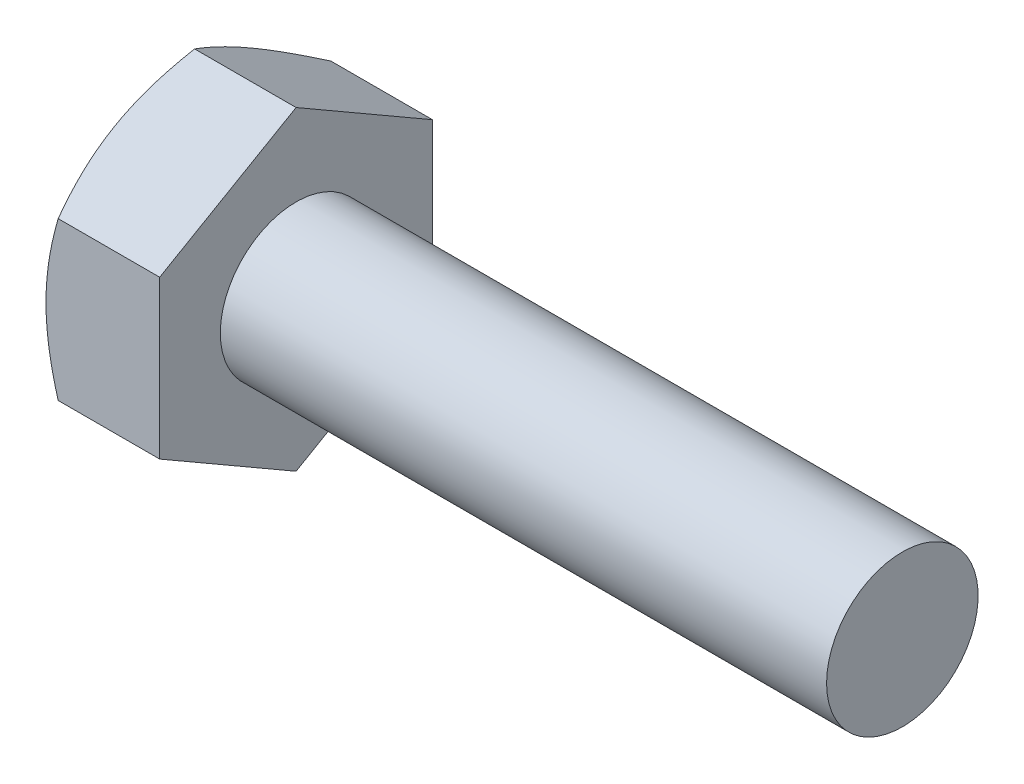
from build123d import *

# Parameters (mm, degrees)
SKETCH2_R     = 10.496535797
HEX_DIE_DEPTH = 7.5
SKETCH4_R     = 7.875
INDENT_DEPTH  = 0.9375


with BuildPart() as part:
    # BodySke → Base-Revolve (revolve)
    with BuildSketch(Plane.XY, mode=Mode.PRIVATE) as base_revolve_sk:
        Polygon((7.5, 5), (7.5, 10.3926097), (0.804023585, 10.3926097), (0, 9), (0, 0), (47.5, 0), (47.5, 5), align=None)
    revolve(base_revolve_sk.sketch.rotate(Axis((-25.4, 0, 0), (1, 0, 0)), 90), axis=Axis((-25.4, 0, 0), (1, 0, 0)))

    # Sketch2 → Hex-Die (cut)
    with BuildSketch(Plane(origin=(0, 0, 0), x_dir=(0, 0, -1), z_dir=(1, 0, 0))):
        Circle(SKETCH2_R)
        Polygon((-9, 5.196152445), (0, 10.392304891), (9, 5.196152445), (9, -5.196152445), (0, -10.392304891), (-9, -5.196152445), align=None, mode=Mode.SUBTRACT)
    extrude(amount=HEX_DIE_DEPTH, mode=Mode.SUBTRACT)

    # Sketch4 → Indent (cut)
    with BuildSketch(Plane(origin=(0, 0, 0), x_dir=(0, 0, -1), z_dir=(1, 0, 0))):
        Circle(SKETCH4_R)
    extrude(amount=INDENT_DEPTH, mode=Mode.SUBTRACT)


solid = part.part
